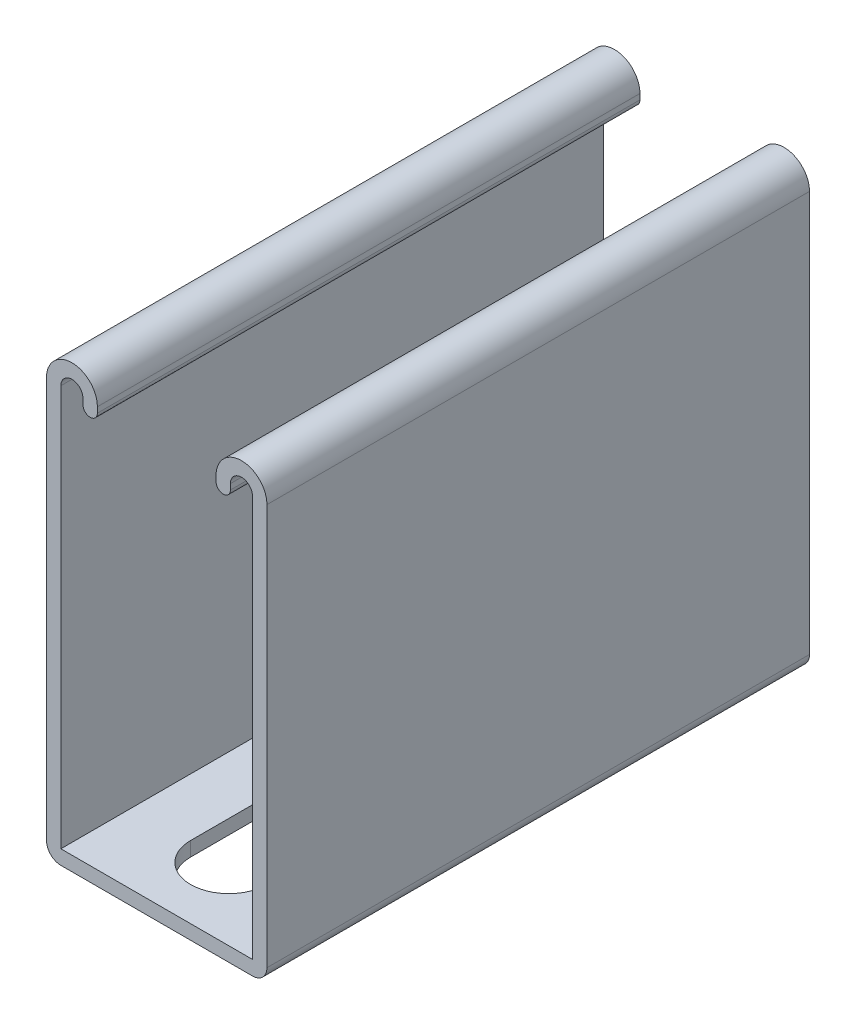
from build123d import *

# Parameters (mm, degrees)
BASE_EXTRUDE_DEPTH = 101.6
SLOT_DEPTH         = 145.160282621
LPATTERN1_COUNT    = 2
LPATTERN1_PITCH    = 50.8


with BuildPart() as part:
    # Sketch1 → Base-Extrude (new body)
    with BuildSketch(Plane.XY):
        with BuildLine():
            Line((-20.6375, 39.6875), (-20.6375, -35.4076))
            ThreePointArc((-20.6375, -35.4076), (-19.848914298, -37.311414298), (-17.9451, -38.1))
            Line((-17.9451, -38.1), (17.9451, -38.1))
            ThreePointArc((17.9451, -38.1), (19.848914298, -37.311414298), (20.6375, -35.4076))
            Line((20.6375, -35.4076), (20.6375, 39.6875))
            ThreePointArc((20.6375, 39.6875), (15.875, 44.45), (11.1125, 39.6875))
            Line((11.1125, 39.6875), (11.1125, 38.65245))
            ThreePointArc((11.1125, 38.65245), (12.4587, 37.30625), (13.8049, 38.65245))
            Line((13.8049, 38.65245), (13.8049, 39.6875))
            ThreePointArc((13.8049, 39.6875), (15.875, 41.7576), (17.9451, 39.6875))
            Line((17.9451, 39.6875), (17.9451, -35.4076))
            Line((17.9451, -35.4076), (-17.9451, -35.4076))
            Line((-17.9451, -35.4076), (-17.9451, 39.6875))
            ThreePointArc((-17.9451, 39.6875), (-15.875, 41.7576), (-13.8049, 39.6875))
            Line((-13.8049, 39.6875), (-13.8049, 38.65245))
            ThreePointArc((-13.8049, 38.65245), (-12.4587, 37.30625), (-11.1125, 38.65245))
            Line((-11.1125, 38.65245), (-11.1125, 39.6875))
            ThreePointArc((-11.1125, 39.6875), (-15.875, 44.45), (-20.6375, 39.6875))
        make_face()
    extrude(amount=BASE_EXTRUDE_DEPTH)

    # Sketch2 → Slot (cut, through all)
    with BuildSketch(Plane(origin=(-0.560706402, -38.1, -14.668313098), x_dir=(1, 0, 0), z_dir=(0, -1, 0))):
        with BuildLine():
            Line((7.704456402, 51.974563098), (7.704456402, 37.687063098))
            ThreePointArc((7.704456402, 37.687063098), (0.560706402, 30.543313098), (-6.583043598, 37.687063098))
            Line((-6.583043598, 37.687063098), (-6.583043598, 51.974563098))
            ThreePointArc((-6.583043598, 51.974563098), (0.560706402, 59.118313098), (7.704456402, 51.974563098))
        make_face()
    slot = extrude(amount=-SLOT_DEPTH, mode=Mode.SUBTRACT)

    # LPattern1: Slot ×2
    with Locations(*[(0, 0, i * LPATTERN1_PITCH) for i in range(1, LPATTERN1_COUNT)]):
        add(slot, mode=Mode.SUBTRACT)


solid = part.part
